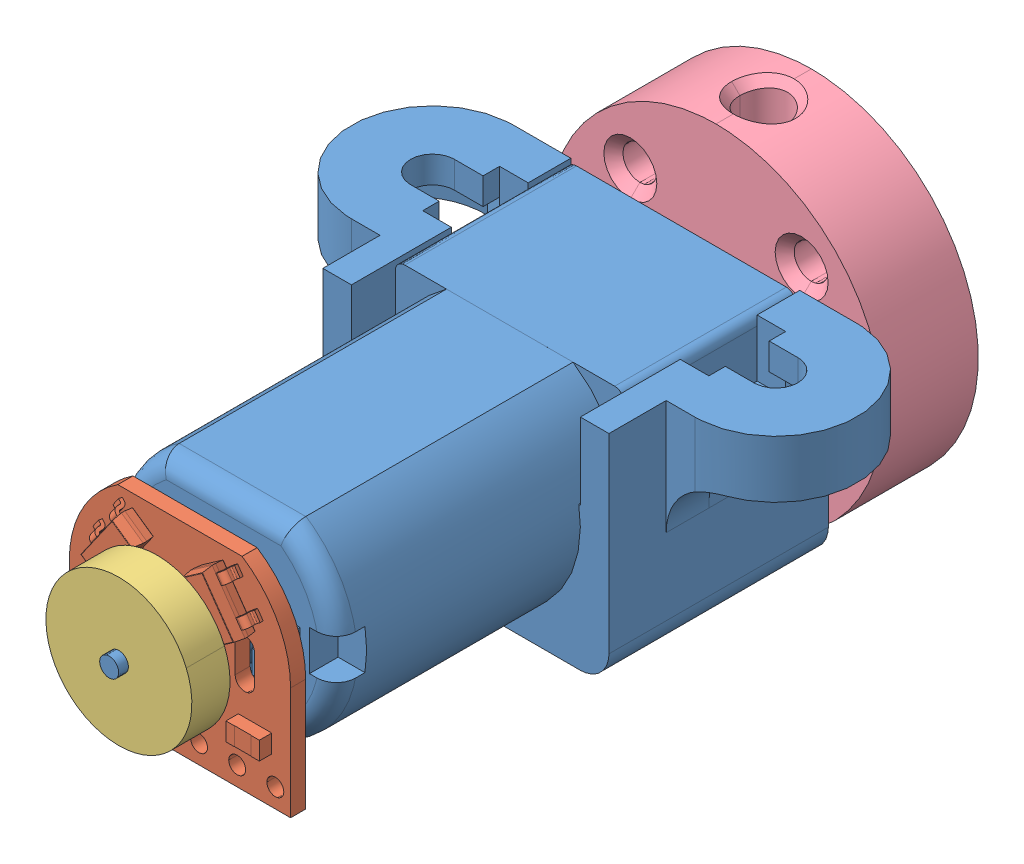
SolidWorks assembly Assem-motor with hub.SLDASM, configuration Default (file format 14000). Lengths in mm.
Overall size (26.51 17.5 39.27).
5 component instances, 4 part files, 1 mates.
Components (placement in the parent):
- Assem-motor-1: Assem-motor.SLDASM [Default] at (-54.8869 -11.9145 50.8863) size (26.51 11.71 39.27)
  - motor dual shaft-1: motor dual shaft.SLDPRT [Default] at (14.3298 18 -34.4067) x (0 0 -1) z (-1 0 0) size (39.27 11.71 26.51)
  - motor-encoder1-1: motor-encoder1.SLDPRT [Default] at (14.3298 18 -17.9067) size (11.6 10.6 1.99)
  - motor-encoder2-1: motor-encoder2.SLDPRT [Default] at (14.3298 18 -13.9167) x (-0.923728 -0.383049 0) z (0 0 -1) size (7.65 7.65 2)
- pololu-universal-aluminum-mounting-hub-for-3mm-shaft-2-56-holes.step-1: motor-mounting hub.SLDPRT [Default] at (-40.5571 6.0856 3.1688) size (17.5 17.5 5)
Mates (geometry in assembly coordinates):
- Concentric1: concentric anti-aligned: cylinder of Assem-motor-1/motor dual shaft-1 through (-40.5571 6.0855 -2.5204) axis (0 0 1) radius 1.5; cylinder of pololu-universal-aluminum-mounting-hub-for-3mm-shaft-2-56-holes.step-1 through (-40.5571 6.0855 5.6698) axis (0 0 -1) radius 1.5
